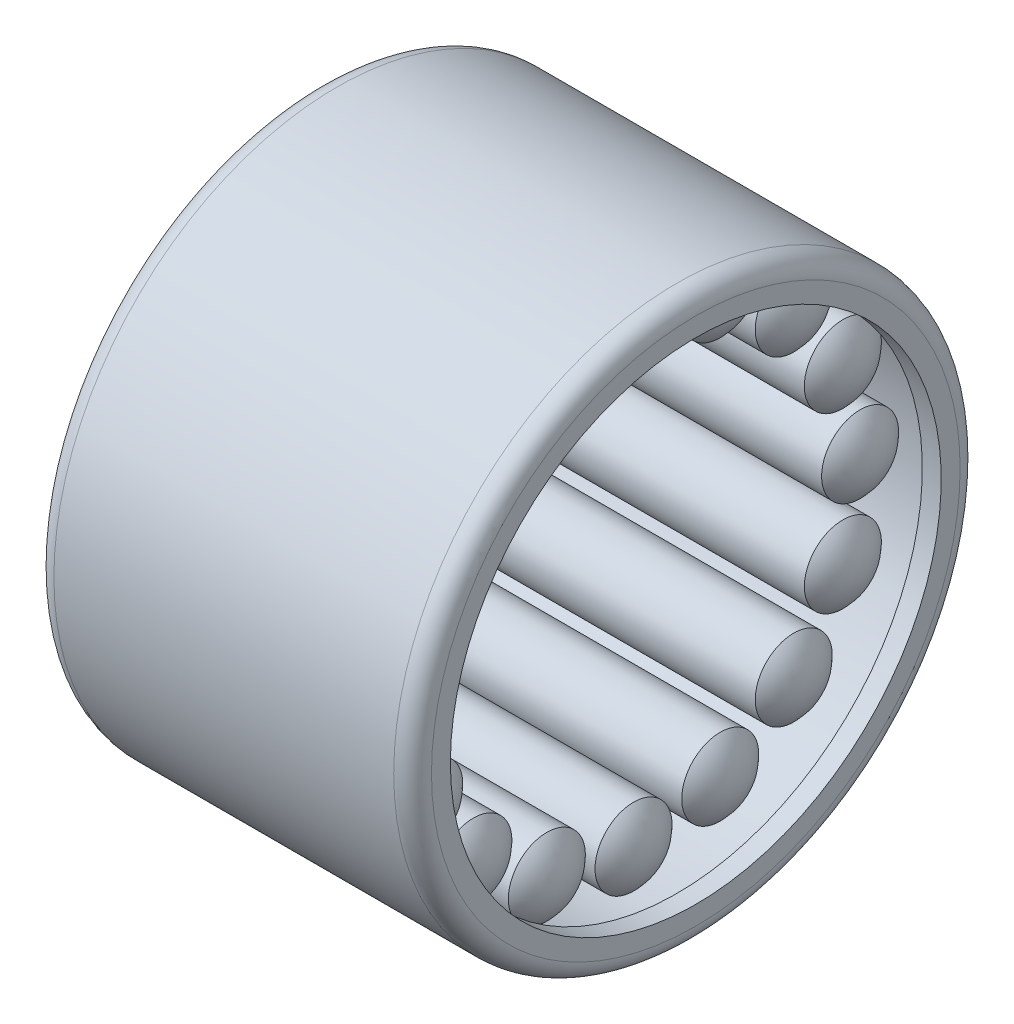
from build123d import *

# Parameters (mm, degrees)
R_P_TITION_CIRCULAIRE1_COUNT = 16


with BuildPart() as part:
    # Esquisse1 → Base-R_volution (revolve)
    with BuildSketch(Plane.XY, mode=Mode.PRIVATE) as base_r_volution_sk:
        with BuildLine():
            Line((0, 0), (0, 1))
            Line((0, 1), (-0.2, 1))
            Line((-0.2, 1), (-0.2, 4))
            Line((-0.2, 4), (0, 4))
            Line((0, 4), (0, 5.5))
            Line((0, 5.5), (-0.2, 5.5))
            Line((-0.2, 5.5), (-0.2, 7))
            ThreePointArc((-0.2, 7), (-0.053553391, 7.353553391), (0.3, 7.5))
            Line((0.3, 7.5), (9.3, 7.5))
            ThreePointArc((9.3, 7.5), (9.653553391, 7.353553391), (9.8, 7))
            Line((9.8, 7), (9.8, 6.5))
            Line((9.8, 6.5), (9.3, 6.5))
            Line((9.3, 6.5), (9.3, 7))
            Line((9.3, 7), (0.3, 7))
            Line((0.3, 7), (0.3, 5.5))
            Line((0.3, 5.5), (0.5, 5.5))
            Line((0.5, 5.5), (0.5, 4))
            Line((0.5, 4), (0.3, 4))
            Line((0.3, 4), (0.3, 1))
            Line((0.3, 1), (0.5, 1))
            Line((0.5, 1), (0.5, 0))
            Line((0.5, 0), (0, 0))
        make_face()
    revolve(base_r_volution_sk.sketch.rotate(Axis((0, 0, 0), (1, 0, 0)), 90), axis=Axis((0, 0, 0), (1, 0, 0)))

    # Esquisse2 → Boss.-R_vol.2 (revolve)
    with BuildSketch(Plane.XY):
        with BuildLine():
            Line((1.020408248, 7.02), (8.151164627, 7.02))
            ThreePointArc((8.151164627, 7.02), (8.472601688, 6.554368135), (8.585786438, 6))
            Line((8.585786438, 6), (0.585786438, 6))
            ThreePointArc((0.585786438, 6), (0.698971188, 6.554368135), (1.020408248, 7.02))
        make_face()
    boss_r_vol_2 = revolve(axis=Axis((1, 6, 0), (1, 0, 0)))

    # R_p_tition circulaire1: Boss.-R_vol.2 ×16 about axis
    r_p_tition_circulaire1_axis = Axis((0, 0, 0), (1, 0, 0))
    for i in range(1, R_P_TITION_CIRCULAIRE1_COUNT):
        add(boss_r_vol_2.rotate(r_p_tition_circulaire1_axis, i * 360 / R_P_TITION_CIRCULAIRE1_COUNT))


solid = part.part
